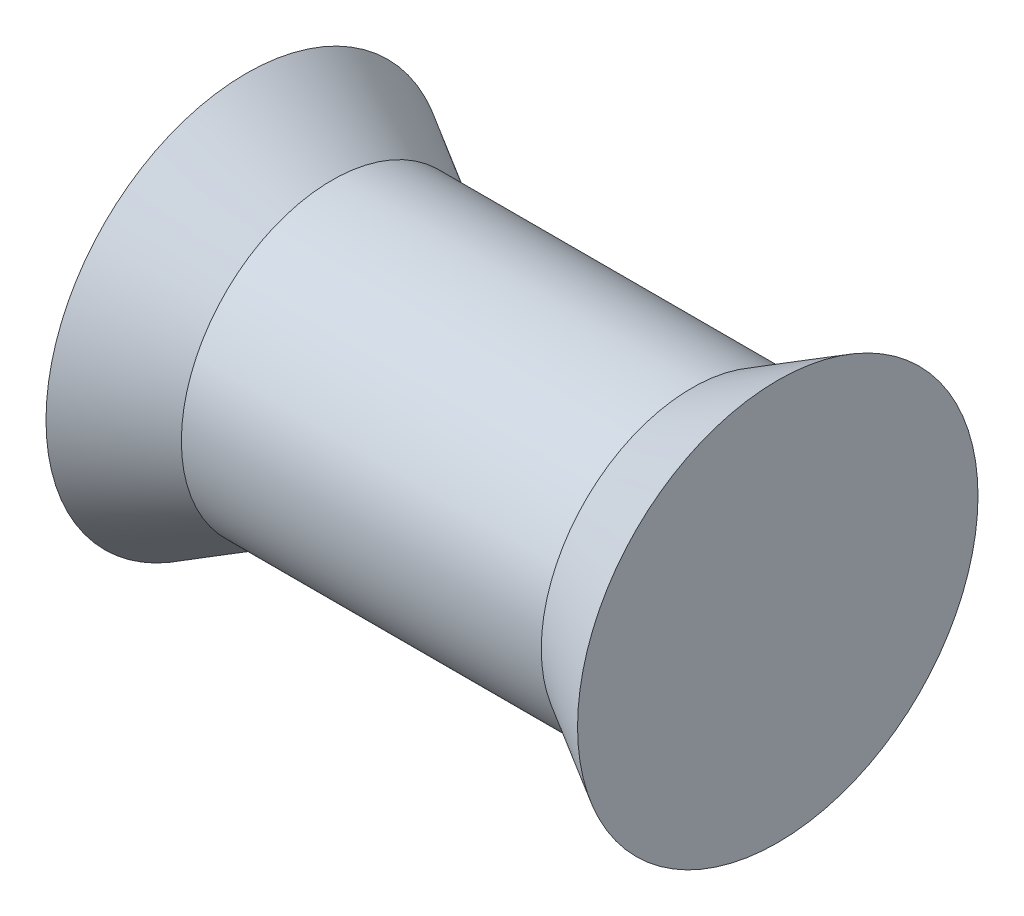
ISO-10303-21;
HEADER;
FILE_DESCRIPTION(('STEP AP214'),'2;1');
FILE_NAME('part.step','',(''),(''),'','','');
FILE_SCHEMA(('AUTOMOTIVE_DESIGN { 1 0 10303 214 1 1 1 1 }'));
ENDSEC;
DATA;
#1=APPLICATION_CONTEXT('core data for automotive mechanical design processes');
#2=APPLICATION_PROTOCOL_DEFINITION('international standard','automotive_design',2000,#1);
#3=PRODUCT_CONTEXT('',#1,'mechanical');
#4=PRODUCT('Part','Part','',(#3));
#5=PRODUCT_RELATED_PRODUCT_CATEGORY('part','',(#4));
#6=PRODUCT_DEFINITION_FORMATION('','',#4);
#7=PRODUCT_DEFINITION_CONTEXT('part definition',#1,'design');
#8=PRODUCT_DEFINITION('design','',#6,#7);
#9=PRODUCT_DEFINITION_SHAPE('','',#8);
#10=(LENGTH_UNIT() NAMED_UNIT(*) SI_UNIT(.MILLI.,.METRE.));
#11=(NAMED_UNIT(*) PLANE_ANGLE_UNIT() SI_UNIT($,.RADIAN.));
#12=(NAMED_UNIT(*) SI_UNIT($,.STERADIAN.) SOLID_ANGLE_UNIT());
#13=UNCERTAINTY_MEASURE_WITH_UNIT(LENGTH_MEASURE(1.E-05),#10,'distance_accuracy_value','');
#14=(GEOMETRIC_REPRESENTATION_CONTEXT(3) GLOBAL_UNCERTAINTY_ASSIGNED_CONTEXT((#13)) GLOBAL_UNIT_ASSIGNED_CONTEXT((#10,
#11,#12)) REPRESENTATION_CONTEXT('',''));
#15=CARTESIAN_POINT('',(0.,0.,0.));
#16=DIRECTION('',(0.,0.,1.));
#17=DIRECTION('',(1.,0.,0.));
#18=AXIS2_PLACEMENT_3D('',#15,#16,#17);
#19=CARTESIAN_POINT('',(0.,0.,0.));
#20=DIRECTION('',(1.,0.,0.));
#21=DIRECTION('',(0.,0.,-1.));
#22=AXIS2_PLACEMENT_3D('',#19,#20,#21);
#23=PLANE('',#22);
#24=CARTESIAN_POINT('',(0.,0.,0.));
#25=DIRECTION('',(1.,0.,0.));
#26=DIRECTION('',(0.,0.,-1.));
#27=AXIS2_PLACEMENT_3D('',#24,#25,#26);
#28=CIRCLE('',#27,3.67400120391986);
#29=CARTESIAN_POINT('',(0.,0.,-3.67400120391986));
#30=VERTEX_POINT('',#29);
#31=EDGE_CURVE('E10',#30,#30,#28,.T.);
#32=ORIENTED_EDGE('',*,*,#31,.T.);
#33=EDGE_LOOP('',(#32));
#34=FACE_BOUND('',#33,.T.);
#35=ADVANCED_FACE('F35',(#34),#23,.T.);
#36=CARTESIAN_POINT('',(0.,0.,0.));
#37=DIRECTION('',(1.,0.,0.));
#38=DIRECTION('',(0.,0.,-1.));
#39=AXIS2_PLACEMENT_3D('',#36,#37,#38);
#40=CONICAL_SURFACE('',#39,3.67400120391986,0.523598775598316);
#41=CARTESIAN_POINT('',(-1.5748,0.,0.));
#42=DIRECTION('',(1.,0.,0.));
#43=DIRECTION('',(0.,0.,-1.));
#44=AXIS2_PLACEMENT_3D('',#41,#42,#43);
#45=CIRCLE('',#44,2.76479);
#46=CARTESIAN_POINT('',(-1.5748,0.,-2.76479));
#47=VERTEX_POINT('',#46);
#48=EDGE_CURVE('E41',#47,#47,#45,.T.);
#49=ORIENTED_EDGE('',*,*,#48,.T.);
#50=EDGE_LOOP('',(#49));
#51=FACE_BOUND('',#50,.T.);
#52=ORIENTED_EDGE('',*,*,#31,.F.);
#53=EDGE_LOOP('',(#52));
#54=FACE_BOUND('',#53,.T.);
#55=ADVANCED_FACE('F67',(#51,#54),#40,.T.);
#56=CARTESIAN_POINT('',(0.,0.,0.));
#57=DIRECTION('',(1.,0.,0.));
#58=DIRECTION('',(0.,0.,-1.));
#59=AXIS2_PLACEMENT_3D('',#56,#57,#58);
#60=CYLINDRICAL_SURFACE('',#59,2.76479);
#61=CARTESIAN_POINT('',(-8.1788,0.,0.));
#62=DIRECTION('',(1.,0.,0.));
#63=DIRECTION('',(0.,0.,-1.));
#64=AXIS2_PLACEMENT_3D('',#61,#62,#63);
#65=CIRCLE('',#64,2.76479);
#66=CARTESIAN_POINT('',(-8.1788,0.,-2.76479));
#67=VERTEX_POINT('',#66);
#68=EDGE_CURVE('E45',#67,#67,#65,.T.);
#69=ORIENTED_EDGE('',*,*,#68,.T.);
#70=EDGE_LOOP('',(#69));
#71=FACE_BOUND('',#70,.T.);
#72=ORIENTED_EDGE('',*,*,#48,.F.);
#73=EDGE_LOOP('',(#72));
#74=FACE_BOUND('',#73,.T.);
#75=ADVANCED_FACE('F64',(#71,#74),#60,.T.);
#76=CARTESIAN_POINT('',(-8.1788,0.,0.));
#77=DIRECTION('',(-1.,0.,0.));
#78=DIRECTION('',(0.,0.,1.));
#79=AXIS2_PLACEMENT_3D('',#76,#77,#78);
#80=CONICAL_SURFACE('',#79,2.76479,0.5235987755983);
#81=CARTESIAN_POINT('',(-9.7536,0.,0.));
#82=DIRECTION('',(1.,0.,0.));
#83=DIRECTION('',(0.,0.,-1.));
#84=AXIS2_PLACEMENT_3D('',#81,#82,#83);
#85=CIRCLE('',#84,3.67400120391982);
#86=CARTESIAN_POINT('',(-9.7536,0.,-3.67400120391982));
#87=VERTEX_POINT('',#86);
#88=EDGE_CURVE('E49',#87,#87,#85,.T.);
#89=ORIENTED_EDGE('',*,*,#88,.T.);
#90=EDGE_LOOP('',(#89));
#91=FACE_BOUND('',#90,.T.);
#92=ORIENTED_EDGE('',*,*,#68,.F.);
#93=EDGE_LOOP('',(#92));
#94=FACE_BOUND('',#93,.T.);
#95=ADVANCED_FACE('F55',(#91,#94),#80,.T.);
#96=CARTESIAN_POINT('',(-9.7536,3.67400120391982,0.));
#97=DIRECTION('',(-1.,0.,0.));
#98=DIRECTION('',(0.,0.,1.));
#99=AXIS2_PLACEMENT_3D('',#96,#97,#98);
#100=PLANE('',#99);
#101=ORIENTED_EDGE('',*,*,#88,.F.);
#102=EDGE_LOOP('',(#101));
#103=FACE_BOUND('',#102,.T.);
#104=ADVANCED_FACE('F58',(#103),#100,.T.);
#105=CLOSED_SHELL('',(#35,#55,#75,#95,#104));
#106=MANIFOLD_SOLID_BREP('B2',#105);
#107=ADVANCED_BREP_SHAPE_REPRESENTATION('',(#18,#106),#14);
#108=SHAPE_DEFINITION_REPRESENTATION(#9,#107);
ENDSEC;
END-ISO-10303-21;
